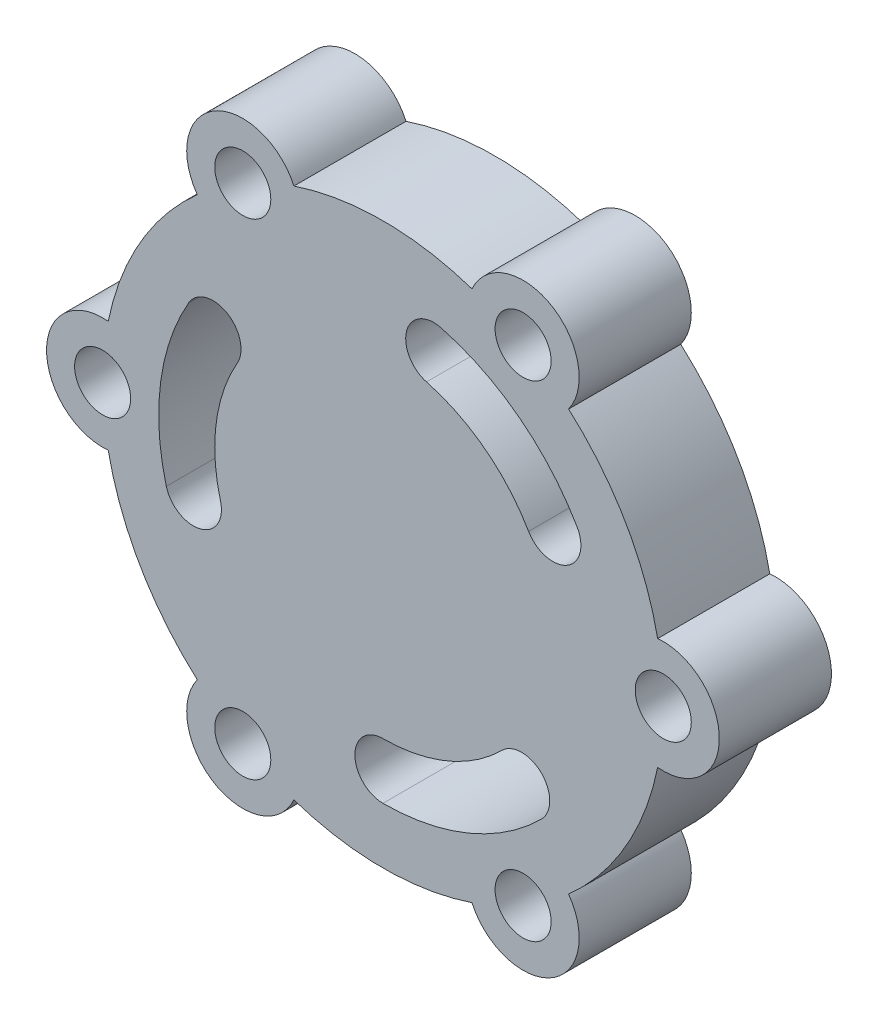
from build123d import *

# Parameters (mm, degrees)
SKETCH2_R           = 5
BOSS_EXTRUDE1_DEPTH = 20


with BuildPart() as part:
    # Sketch2 → Boss-Extrude1 (new body)
    with BuildSketch(Plane.XY):
        with BuildLine():
            ThreePointArc((119, 79.949874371), (113.301270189, 95), (103.11684397, 107.4603076))
            ThreePointArc((103.11684397, 107.4603076), (100, 121.961524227), (85.88315603, 117.410181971))
            ThreePointArc((85.88315603, 117.410181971), (70, 120), (54.11684397, 117.410181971))
            ThreePointArc((54.11684397, 117.410181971), (40, 121.961524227), (36.88315603, 107.4603076))
            ThreePointArc((36.88315603, 107.4603076), (26.698729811, 95), (21, 79.949874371))
            ThreePointArc((21, 79.949874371), (10, 70), (21, 60.050125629))
            ThreePointArc((21, 60.050125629), (26.698729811, 45), (36.88315603, 32.5396924))
            ThreePointArc((36.88315603, 32.5396924), (40, 18.038475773), (54.11684397, 22.589818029))
            ThreePointArc((54.11684397, 22.589818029), (70, 20), (85.88315603, 22.589818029))
            ThreePointArc((85.88315603, 22.589818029), (100, 18.038475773), (103.11684397, 32.5396924))
            ThreePointArc((103.11684397, 32.5396924), (113.301270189, 45), (119, 60.050125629))
            ThreePointArc((119, 60.050125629), (130, 70), (119, 79.949874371))
        make_face()
        with Locations((120, 70)):
            Circle(SKETCH2_R, mode=Mode.SUBTRACT)
        with Locations((95, 26.698729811)):
            Circle(SKETCH2_R, mode=Mode.SUBTRACT)
        with Locations((45, 26.698729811)):
            Circle(SKETCH2_R, mode=Mode.SUBTRACT)
        with Locations((20, 70)):
            Circle(SKETCH2_R, mode=Mode.SUBTRACT)
        with Locations((45, 113.301270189)):
            Circle(SKETCH2_R, mode=Mode.SUBTRACT)
        with Locations((95, 113.301270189)):
            Circle(SKETCH2_R, mode=Mode.SUBTRACT)
        with BuildLine():
            ThreePointArc((104.641016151, 90), (94.35045716, 101.734133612), (80.352761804, 108.637033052))
            ThreePointArc((80.352761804, 108.637033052), (74.229037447, 105.101499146), (77.764571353, 98.977774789))
            ThreePointArc((77.764571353, 98.977774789), (88.26284287, 93.800600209), (95.980762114, 85))
            ThreePointArc((95.980762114, 85), (102.810889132, 83.169872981), (104.641016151, 90))
        make_face(mode=Mode.SUBTRACT)
        with BuildLine():
            ThreePointArc((70, 30), (85.307337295, 33.0448187), (98.284271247, 41.715728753))
            ThreePointArc((98.284271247, 41.715728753), (98.284271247, 48.786796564), (91.213203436, 48.786796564))
            ThreePointArc((91.213203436, 48.786796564), (81.480502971, 42.283614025), (70, 40))
            ThreePointArc((70, 40), (65, 35), (70, 30))
        make_face(mode=Mode.SUBTRACT)
        with BuildLine():
            ThreePointArc((35.358983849, 90), (30.342205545, 75.221047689), (31.362966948, 59.647238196))
            ThreePointArc((31.362966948, 59.647238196), (37.486691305, 56.11170429), (41.022225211, 62.235428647))
            ThreePointArc((41.022225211, 62.235428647), (40.256654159, 73.915785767), (44.019237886, 85))
            ThreePointArc((44.019237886, 85), (42.189110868, 91.830127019), (35.358983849, 90))
        make_face(mode=Mode.SUBTRACT)
    extrude(amount=BOSS_EXTRUDE1_DEPTH)


solid = part.part
